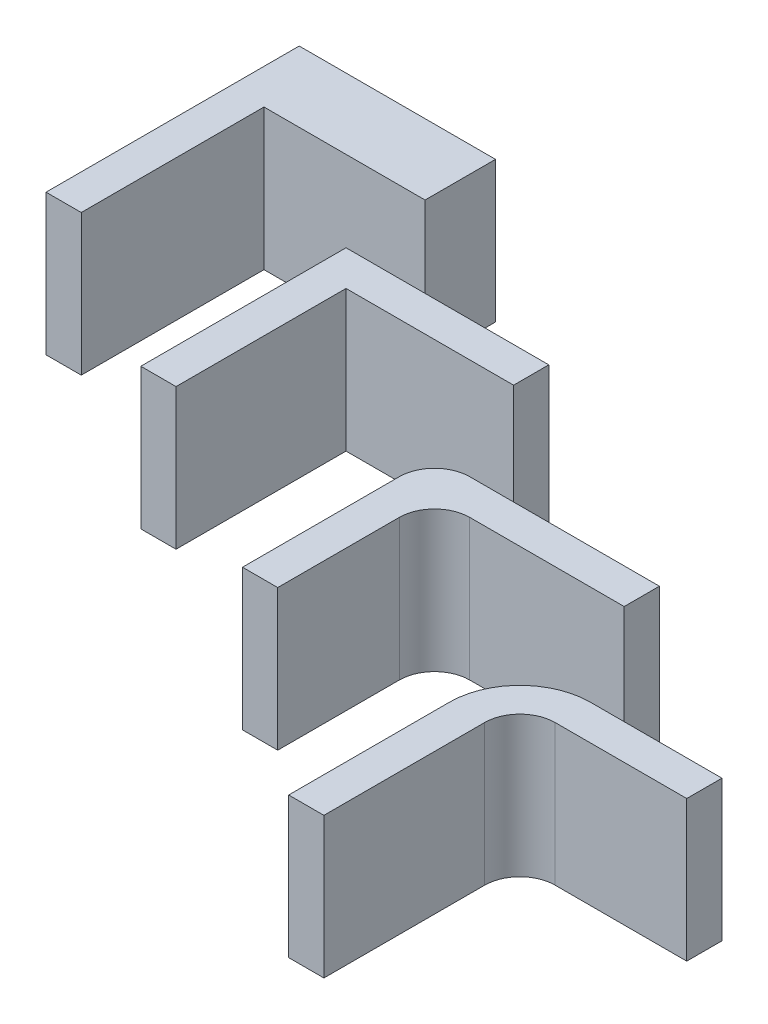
ISO-10303-21;
HEADER;
FILE_DESCRIPTION(('STEP AP214'),'2;1');
FILE_NAME('part.step','',(''),(''),'','','');
FILE_SCHEMA(('AUTOMOTIVE_DESIGN { 1 0 10303 214 1 1 1 1 }'));
ENDSEC;
DATA;
#1=APPLICATION_CONTEXT('core data for automotive mechanical design processes');
#2=APPLICATION_PROTOCOL_DEFINITION('international standard','automotive_design',2000,#1);
#3=PRODUCT_CONTEXT('',#1,'mechanical');
#4=PRODUCT('Part','Part','',(#3));
#5=PRODUCT_RELATED_PRODUCT_CATEGORY('part','',(#4));
#6=PRODUCT_DEFINITION_FORMATION('','',#4);
#7=PRODUCT_DEFINITION_CONTEXT('part definition',#1,'design');
#8=PRODUCT_DEFINITION('design','',#6,#7);
#9=PRODUCT_DEFINITION_SHAPE('','',#8);
#10=(LENGTH_UNIT() NAMED_UNIT(*) SI_UNIT(.MILLI.,.METRE.));
#11=(NAMED_UNIT(*) PLANE_ANGLE_UNIT() SI_UNIT($,.RADIAN.));
#12=(NAMED_UNIT(*) SI_UNIT($,.STERADIAN.) SOLID_ANGLE_UNIT());
#13=UNCERTAINTY_MEASURE_WITH_UNIT(LENGTH_MEASURE(1.E-05),#10,'distance_accuracy_value','');
#14=(GEOMETRIC_REPRESENTATION_CONTEXT(3) GLOBAL_UNCERTAINTY_ASSIGNED_CONTEXT((#13)) GLOBAL_UNIT_ASSIGNED_CONTEXT((#10,
#11,#12)) REPRESENTATION_CONTEXT('',''));
#15=CARTESIAN_POINT('',(0.,0.,0.));
#16=DIRECTION('',(0.,0.,1.));
#17=DIRECTION('',(1.,0.,0.));
#18=AXIS2_PLACEMENT_3D('',#15,#16,#17);
#19=CARTESIAN_POINT('',(120.02384587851,20.,24.0672258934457));
#20=DIRECTION('',(-1.,0.,0.));
#21=DIRECTION('',(0.,0.,1.));
#22=AXIS2_PLACEMENT_3D('',#19,#20,#21);
#23=PLANE('',#22);
#24=DIRECTION('',(0.,0.,-1.));
#25=VECTOR('',#24,1.);
#26=CARTESIAN_POINT('',(120.02384587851,0.,24.0672258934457));
#27=LINE('',#26,#25);
#28=CARTESIAN_POINT('',(120.02384587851,0.,29.0672258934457));
#29=VERTEX_POINT('',#28);
#30=CARTESIAN_POINT('',(120.02384587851,0.,24.0672258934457));
#31=VERTEX_POINT('',#30);
#32=EDGE_CURVE('E143',#29,#31,#27,.T.);
#33=ORIENTED_EDGE('',*,*,#32,.T.);
#34=DIRECTION('',(0.,-1.,0.));
#35=VECTOR('',#34,1.);
#36=CARTESIAN_POINT('',(120.02384587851,20.,24.0672258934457));
#37=LINE('',#36,#35);
#38=CARTESIAN_POINT('',(120.02384587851,20.,24.0672258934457));
#39=VERTEX_POINT('',#38);
#40=EDGE_CURVE('E12',#39,#31,#37,.T.);
#41=ORIENTED_EDGE('',*,*,#40,.F.);
#42=DIRECTION('',(0.,0.,-1.));
#43=VECTOR('',#42,1.);
#44=CARTESIAN_POINT('',(120.02384587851,20.,24.0672258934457));
#45=LINE('',#44,#43);
#46=CARTESIAN_POINT('',(120.02384587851,20.,29.0672258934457));
#47=VERTEX_POINT('',#46);
#48=EDGE_CURVE('E157',#47,#39,#45,.T.);
#49=ORIENTED_EDGE('',*,*,#48,.F.);
#50=DIRECTION('',(0.,-1.,0.));
#51=VECTOR('',#50,1.);
#52=CARTESIAN_POINT('',(120.02384587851,20.,29.0672258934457));
#53=LINE('',#52,#51);
#54=EDGE_CURVE('E139',#47,#29,#53,.T.);
#55=ORIENTED_EDGE('',*,*,#54,.T.);
#56=EDGE_LOOP('',(#33,#41,#49,#55));
#57=FACE_BOUND('',#56,.T.);
#58=ADVANCED_FACE('F47',(#57),#23,.F.);
#59=CARTESIAN_POINT('',(120.02384587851,20.,24.0672258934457));
#60=DIRECTION('',(0.,0.,1.));
#61=DIRECTION('',(1.,0.,0.));
#62=AXIS2_PLACEMENT_3D('',#59,#60,#61);
#63=PLANE('',#62);
#64=DIRECTION('',(-1.,0.,0.));
#65=VECTOR('',#64,1.);
#66=CARTESIAN_POINT('',(120.02384587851,0.,24.0672258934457));
#67=LINE('',#66,#65);
#68=CARTESIAN_POINT('',(101.336441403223,0.,24.0672258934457));
#69=VERTEX_POINT('',#68);
#70=EDGE_CURVE('E146',#31,#69,#67,.T.);
#71=ORIENTED_EDGE('',*,*,#70,.T.);
#72=DIRECTION('',(0.,-1.,0.));
#73=VECTOR('',#72,1.);
#74=CARTESIAN_POINT('',(101.336441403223,20.,24.0672258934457));
#75=LINE('',#74,#73);
#76=CARTESIAN_POINT('',(101.336441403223,20.,24.0672258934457));
#77=VERTEX_POINT('',#76);
#78=EDGE_CURVE('E55',#77,#69,#75,.T.);
#79=ORIENTED_EDGE('',*,*,#78,.F.);
#80=DIRECTION('',(-1.,0.,0.));
#81=VECTOR('',#80,1.);
#82=CARTESIAN_POINT('',(120.02384587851,20.,24.0672258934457));
#83=LINE('',#82,#81);
#84=EDGE_CURVE('E106',#39,#77,#83,.T.);
#85=ORIENTED_EDGE('',*,*,#84,.F.);
#86=ORIENTED_EDGE('',*,*,#40,.T.);
#87=EDGE_LOOP('',(#71,#79,#85,#86));
#88=FACE_BOUND('',#87,.T.);
#89=ADVANCED_FACE('F192',(#88),#63,.F.);
#90=CARTESIAN_POINT('',(101.336441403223,20.,34.0672258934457));
#91=DIRECTION('',(0.,-1.,0.));
#92=DIRECTION('',(0.,0.,-1.));
#93=AXIS2_PLACEMENT_3D('',#90,#91,#92);
#94=CYLINDRICAL_SURFACE('',#93,10.);
#95=CARTESIAN_POINT('',(101.336441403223,0.,34.0672258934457));
#96=DIRECTION('',(0.,1.,0.));
#97=DIRECTION('',(0.,0.,1.));
#98=AXIS2_PLACEMENT_3D('',#95,#96,#97);
#99=CIRCLE('',#98,10.);
#100=CARTESIAN_POINT('',(91.3364414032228,0.,34.0672258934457));
#101=VERTEX_POINT('',#100);
#102=EDGE_CURVE('E148',#69,#101,#99,.T.);
#103=ORIENTED_EDGE('',*,*,#102,.T.);
#104=DIRECTION('',(0.,-1.,0.));
#105=VECTOR('',#104,1.);
#106=CARTESIAN_POINT('',(91.3364414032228,20.,34.0672258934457));
#107=LINE('',#106,#105);
#108=CARTESIAN_POINT('',(91.3364414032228,20.,34.0672258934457));
#109=VERTEX_POINT('',#108);
#110=EDGE_CURVE('E164',#109,#101,#107,.T.);
#111=ORIENTED_EDGE('',*,*,#110,.F.);
#112=CARTESIAN_POINT('',(101.336441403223,20.,34.0672258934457));
#113=DIRECTION('',(0.,1.,0.));
#114=DIRECTION('',(0.,0.,1.));
#115=AXIS2_PLACEMENT_3D('',#112,#113,#114);
#116=CIRCLE('',#115,10.);
#117=EDGE_CURVE('E172',#77,#109,#116,.T.);
#118=ORIENTED_EDGE('',*,*,#117,.F.);
#119=ORIENTED_EDGE('',*,*,#78,.T.);
#120=EDGE_LOOP('',(#103,#111,#118,#119));
#121=FACE_BOUND('',#120,.T.);
#122=ADVANCED_FACE('F170',(#121),#94,.T.);
#123=CARTESIAN_POINT('',(91.3364414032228,20.,34.0672258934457));
#124=DIRECTION('',(1.,0.,0.));
#125=DIRECTION('',(0.,0.,-1.));
#126=AXIS2_PLACEMENT_3D('',#123,#124,#125);
#127=PLANE('',#126);
#128=DIRECTION('',(0.,0.,1.));
#129=VECTOR('',#128,1.);
#130=CARTESIAN_POINT('',(91.3364414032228,0.,34.0672258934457));
#131=LINE('',#130,#129);
#132=CARTESIAN_POINT('',(91.3364414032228,0.,56.8897151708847));
#133=VERTEX_POINT('',#132);
#134=EDGE_CURVE('E150',#101,#133,#131,.T.);
#135=ORIENTED_EDGE('',*,*,#134,.T.);
#136=DIRECTION('',(0.,-1.,0.));
#137=VECTOR('',#136,1.);
#138=CARTESIAN_POINT('',(91.3364414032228,20.,56.8897151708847));
#139=LINE('',#138,#137);
#140=CARTESIAN_POINT('',(91.3364414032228,20.,56.8897151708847));
#141=VERTEX_POINT('',#140);
#142=EDGE_CURVE('E161',#141,#133,#139,.T.);
#143=ORIENTED_EDGE('',*,*,#142,.F.);
#144=DIRECTION('',(0.,0.,1.));
#145=VECTOR('',#144,1.);
#146=CARTESIAN_POINT('',(91.3364414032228,20.,34.0672258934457));
#147=LINE('',#146,#145);
#148=EDGE_CURVE('E184',#109,#141,#147,.T.);
#149=ORIENTED_EDGE('',*,*,#148,.F.);
#150=ORIENTED_EDGE('',*,*,#110,.T.);
#151=EDGE_LOOP('',(#135,#143,#149,#150));
#152=FACE_BOUND('',#151,.T.);
#153=ADVANCED_FACE('F180',(#152),#127,.F.);
#154=CARTESIAN_POINT('',(96.3364414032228,20.,56.8897151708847));
#155=DIRECTION('',(0.,0.,-1.));
#156=DIRECTION('',(-1.,0.,0.));
#157=AXIS2_PLACEMENT_3D('',#154,#155,#156);
#158=PLANE('',#157);
#159=DIRECTION('',(1.,0.,0.));
#160=VECTOR('',#159,1.);
#161=CARTESIAN_POINT('',(96.3364414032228,0.,56.8897151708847));
#162=LINE('',#161,#160);
#163=CARTESIAN_POINT('',(96.3364414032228,0.,56.8897151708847));
#164=VERTEX_POINT('',#163);
#165=EDGE_CURVE('E152',#133,#164,#162,.T.);
#166=ORIENTED_EDGE('',*,*,#165,.T.);
#167=DIRECTION('',(0.,-1.,0.));
#168=VECTOR('',#167,1.);
#169=CARTESIAN_POINT('',(96.3364414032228,20.,56.8897151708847));
#170=LINE('',#169,#168);
#171=CARTESIAN_POINT('',(96.3364414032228,20.,56.8897151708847));
#172=VERTEX_POINT('',#171);
#173=EDGE_CURVE('E134',#172,#164,#170,.T.);
#174=ORIENTED_EDGE('',*,*,#173,.F.);
#175=DIRECTION('',(1.,0.,0.));
#176=VECTOR('',#175,1.);
#177=CARTESIAN_POINT('',(96.3364414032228,20.,56.8897151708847));
#178=LINE('',#177,#176);
#179=EDGE_CURVE('E125',#141,#172,#178,.T.);
#180=ORIENTED_EDGE('',*,*,#179,.F.);
#181=ORIENTED_EDGE('',*,*,#142,.T.);
#182=EDGE_LOOP('',(#166,#174,#180,#181));
#183=FACE_BOUND('',#182,.T.);
#184=ADVANCED_FACE('F183',(#183),#158,.F.);
#185=CARTESIAN_POINT('',(96.3364414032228,20.,34.0672258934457));
#186=DIRECTION('',(-1.,0.,0.));
#187=DIRECTION('',(0.,0.,1.));
#188=AXIS2_PLACEMENT_3D('',#185,#186,#187);
#189=PLANE('',#188);
#190=DIRECTION('',(0.,0.,-1.));
#191=VECTOR('',#190,1.);
#192=CARTESIAN_POINT('',(96.3364414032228,0.,34.0672258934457));
#193=LINE('',#192,#191);
#194=CARTESIAN_POINT('',(96.3364414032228,0.,34.0672258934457));
#195=VERTEX_POINT('',#194);
#196=EDGE_CURVE('E133',#164,#195,#193,.T.);
#197=ORIENTED_EDGE('',*,*,#196,.T.);
#198=DIRECTION('',(0.,-1.,0.));
#199=VECTOR('',#198,1.);
#200=CARTESIAN_POINT('',(96.3364414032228,20.,34.0672258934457));
#201=LINE('',#200,#199);
#202=CARTESIAN_POINT('',(96.3364414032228,20.,34.0672258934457));
#203=VERTEX_POINT('',#202);
#204=EDGE_CURVE('E130',#203,#195,#201,.T.);
#205=ORIENTED_EDGE('',*,*,#204,.F.);
#206=DIRECTION('',(0.,0.,-1.));
#207=VECTOR('',#206,1.);
#208=CARTESIAN_POINT('',(96.3364414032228,20.,34.0672258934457));
#209=LINE('',#208,#207);
#210=EDGE_CURVE('E119',#172,#203,#209,.T.);
#211=ORIENTED_EDGE('',*,*,#210,.F.);
#212=ORIENTED_EDGE('',*,*,#173,.T.);
#213=EDGE_LOOP('',(#197,#205,#211,#212));
#214=FACE_BOUND('',#213,.T.);
#215=ADVANCED_FACE('F131',(#214),#189,.F.);
#216=CARTESIAN_POINT('',(101.336441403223,20.,34.0672258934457));
#217=DIRECTION('',(0.,-1.,0.));
#218=DIRECTION('',(0.,0.,-1.));
#219=AXIS2_PLACEMENT_3D('',#216,#217,#218);
#220=CYLINDRICAL_SURFACE('',#219,4.99999999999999);
#221=CARTESIAN_POINT('',(101.336441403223,0.,34.0672258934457));
#222=DIRECTION('',(0.,-1.,0.));
#223=DIRECTION('',(0.,0.,1.));
#224=AXIS2_PLACEMENT_3D('',#221,#222,#223);
#225=CIRCLE('',#224,4.99999999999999);
#226=CARTESIAN_POINT('',(101.336441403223,0.,29.0672258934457));
#227=VERTEX_POINT('',#226);
#228=EDGE_CURVE('E92',#195,#227,#225,.T.);
#229=ORIENTED_EDGE('',*,*,#228,.T.);
#230=DIRECTION('',(0.,-1.,0.));
#231=VECTOR('',#230,1.);
#232=CARTESIAN_POINT('',(101.336441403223,20.,29.0672258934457));
#233=LINE('',#232,#231);
#234=CARTESIAN_POINT('',(101.336441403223,20.,29.0672258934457));
#235=VERTEX_POINT('',#234);
#236=EDGE_CURVE('E135',#235,#227,#233,.T.);
#237=ORIENTED_EDGE('',*,*,#236,.F.);
#238=CARTESIAN_POINT('',(101.336441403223,20.,34.0672258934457));
#239=DIRECTION('',(0.,-1.,0.));
#240=DIRECTION('',(0.,0.,1.));
#241=AXIS2_PLACEMENT_3D('',#238,#239,#240);
#242=CIRCLE('',#241,4.99999999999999);
#243=EDGE_CURVE('E123',#203,#235,#242,.T.);
#244=ORIENTED_EDGE('',*,*,#243,.F.);
#245=ORIENTED_EDGE('',*,*,#204,.T.);
#246=EDGE_LOOP('',(#229,#237,#244,#245));
#247=FACE_BOUND('',#246,.T.);
#248=ADVANCED_FACE('F137',(#247),#220,.F.);
#249=CARTESIAN_POINT('',(120.02384587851,20.,29.0672258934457));
#250=DIRECTION('',(0.,0.,-1.));
#251=DIRECTION('',(-1.,0.,0.));
#252=AXIS2_PLACEMENT_3D('',#249,#250,#251);
#253=PLANE('',#252);
#254=DIRECTION('',(1.,0.,0.));
#255=VECTOR('',#254,1.);
#256=CARTESIAN_POINT('',(120.02384587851,0.,29.0672258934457));
#257=LINE('',#256,#255);
#258=EDGE_CURVE('E98',#227,#29,#257,.T.);
#259=ORIENTED_EDGE('',*,*,#258,.T.);
#260=ORIENTED_EDGE('',*,*,#54,.F.);
#261=DIRECTION('',(1.,0.,0.));
#262=VECTOR('',#261,1.);
#263=CARTESIAN_POINT('',(120.02384587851,20.,29.0672258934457));
#264=LINE('',#263,#262);
#265=EDGE_CURVE('E63',#235,#47,#264,.T.);
#266=ORIENTED_EDGE('',*,*,#265,.F.);
#267=ORIENTED_EDGE('',*,*,#236,.T.);
#268=EDGE_LOOP('',(#259,#260,#266,#267));
#269=FACE_BOUND('',#268,.T.);
#270=ADVANCED_FACE('F208',(#269),#253,.F.);
#271=CARTESIAN_POINT('',(101.336441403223,20.,34.0672258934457));
#272=DIRECTION('',(0.,1.,0.));
#273=DIRECTION('',(0.,0.,1.));
#274=AXIS2_PLACEMENT_3D('',#271,#272,#273);
#275=PLANE('',#274);
#276=ORIENTED_EDGE('',*,*,#48,.T.);
#277=ORIENTED_EDGE('',*,*,#84,.T.);
#278=ORIENTED_EDGE('',*,*,#117,.T.);
#279=ORIENTED_EDGE('',*,*,#148,.T.);
#280=ORIENTED_EDGE('',*,*,#179,.T.);
#281=ORIENTED_EDGE('',*,*,#210,.T.);
#282=ORIENTED_EDGE('',*,*,#243,.T.);
#283=ORIENTED_EDGE('',*,*,#265,.T.);
#284=EDGE_LOOP('',(#276,#277,#278,#279,#280,#281,#282,#283));
#285=FACE_BOUND('',#284,.T.);
#286=ADVANCED_FACE('F121',(#285),#275,.T.);
#287=CARTESIAN_POINT('',(101.336441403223,0.,34.0672258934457));
#288=DIRECTION('',(0.,1.,0.));
#289=DIRECTION('',(0.,0.,1.));
#290=AXIS2_PLACEMENT_3D('',#287,#288,#289);
#291=PLANE('',#290);
#292=ORIENTED_EDGE('',*,*,#32,.F.);
#293=ORIENTED_EDGE('',*,*,#258,.F.);
#294=ORIENTED_EDGE('',*,*,#228,.F.);
#295=ORIENTED_EDGE('',*,*,#196,.F.);
#296=ORIENTED_EDGE('',*,*,#165,.F.);
#297=ORIENTED_EDGE('',*,*,#134,.F.);
#298=ORIENTED_EDGE('',*,*,#102,.F.);
#299=ORIENTED_EDGE('',*,*,#70,.F.);
#300=EDGE_LOOP('',(#292,#293,#294,#295,#296,#297,#298,#299));
#301=FACE_BOUND('',#300,.T.);
#302=ADVANCED_FACE('F176',(#301),#291,.F.);
#303=CLOSED_SHELL('',(#58,#89,#122,#153,#184,#215,#248,#270,#286,#302));
#304=MANIFOLD_SOLID_BREP('B2',#303);
#305=CARTESIAN_POINT('',(0.,20.,9.90528930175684));
#306=DIRECTION('',(0.,0.,-1.));
#307=DIRECTION('',(-1.,0.,0.));
#308=AXIS2_PLACEMENT_3D('',#305,#306,#307);
#309=PLANE('',#308);
#310=DIRECTION('',(1.,0.,0.));
#311=VECTOR('',#310,1.);
#312=CARTESIAN_POINT('',(0.,20.,9.90528930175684));
#313=LINE('',#312,#311);
#314=CARTESIAN_POINT('',(70.0548102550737,20.,9.90528930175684));
#315=VERTEX_POINT('',#314);
#316=CARTESIAN_POINT('',(91.9806908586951,20.,9.90528930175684));
#317=VERTEX_POINT('',#316);
#318=EDGE_CURVE('E346',#315,#317,#313,.T.);
#319=ORIENTED_EDGE('',*,*,#318,.F.);
#320=DIRECTION('',(0.,-1.,0.));
#321=VECTOR('',#320,1.);
#322=CARTESIAN_POINT('',(70.0548102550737,0.,9.90528930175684));
#323=LINE('',#322,#321);
#324=CARTESIAN_POINT('',(70.0548102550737,0.,9.90528930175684));
#325=VERTEX_POINT('',#324);
#326=EDGE_CURVE('E384',#315,#325,#323,.T.);
#327=ORIENTED_EDGE('',*,*,#326,.T.);
#328=DIRECTION('',(1.,0.,0.));
#329=VECTOR('',#328,1.);
#330=CARTESIAN_POINT('',(0.,0.,9.90528930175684));
#331=LINE('',#330,#329);
#332=CARTESIAN_POINT('',(91.9806908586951,0.,9.90528930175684));
#333=VERTEX_POINT('',#332);
#334=EDGE_CURVE('E368',#325,#333,#331,.T.);
#335=ORIENTED_EDGE('',*,*,#334,.T.);
#336=DIRECTION('',(0.,-1.,0.));
#337=VECTOR('',#336,1.);
#338=CARTESIAN_POINT('',(91.9806908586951,20.,9.90528930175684));
#339=LINE('',#338,#337);
#340=EDGE_CURVE('E361',#317,#333,#339,.T.);
#341=ORIENTED_EDGE('',*,*,#340,.F.);
#342=EDGE_LOOP('',(#319,#327,#335,#341));
#343=FACE_BOUND('',#342,.T.);
#344=ADVANCED_FACE('F284',(#343),#309,.F.);
#345=CARTESIAN_POINT('',(91.980690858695,20.,-5.1059540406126E-13));
#346=DIRECTION('',(-1.,0.,0.));
#347=DIRECTION('',(0.,0.,1.));
#348=AXIS2_PLACEMENT_3D('',#345,#346,#347);
#349=PLANE('',#348);
#350=DIRECTION('',(0.,0.,-1.));
#351=VECTOR('',#350,1.);
#352=CARTESIAN_POINT('',(91.980690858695,0.,-5.1059540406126E-13));
#353=LINE('',#352,#351);
#354=CARTESIAN_POINT('',(91.9806908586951,0.,4.90528930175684));
#355=VERTEX_POINT('',#354);
#356=EDGE_CURVE('E501',#333,#355,#353,.T.);
#357=ORIENTED_EDGE('',*,*,#356,.T.);
#358=DIRECTION('',(0.,-1.,0.));
#359=VECTOR('',#358,1.);
#360=CARTESIAN_POINT('',(91.9806908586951,20.,4.90528930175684));
#361=LINE('',#360,#359);
#362=CARTESIAN_POINT('',(91.9806908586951,20.,4.90528930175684));
#363=VERTEX_POINT('',#362);
#364=EDGE_CURVE('E363',#363,#355,#361,.T.);
#365=ORIENTED_EDGE('',*,*,#364,.F.);
#366=DIRECTION('',(0.,0.,-1.));
#367=VECTOR('',#366,1.);
#368=CARTESIAN_POINT('',(91.980690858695,20.,-5.1059540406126E-13));
#369=LINE('',#368,#367);
#370=EDGE_CURVE('E350',#317,#363,#369,.T.);
#371=ORIENTED_EDGE('',*,*,#370,.F.);
#372=ORIENTED_EDGE('',*,*,#340,.T.);
#373=EDGE_LOOP('',(#357,#365,#371,#372));
#374=FACE_BOUND('',#373,.T.);
#375=ADVANCED_FACE('F360',(#374),#349,.F.);
#376=CARTESIAN_POINT('',(0.,20.,4.90528930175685));
#377=DIRECTION('',(0.,0.,1.));
#378=DIRECTION('',(1.,0.,0.));
#379=AXIS2_PLACEMENT_3D('',#376,#377,#378);
#380=PLANE('',#379);
#381=DIRECTION('',(-1.,0.,0.));
#382=VECTOR('',#381,1.);
#383=CARTESIAN_POINT('',(0.,0.,4.90528930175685));
#384=LINE('',#383,#382);
#385=CARTESIAN_POINT('',(65.0548102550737,0.,4.90528930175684));
#386=VERTEX_POINT('',#385);
#387=EDGE_CURVE('E489',#355,#386,#384,.T.);
#388=ORIENTED_EDGE('',*,*,#387,.T.);
#389=DIRECTION('',(0.,-1.,0.));
#390=VECTOR('',#389,1.);
#391=CARTESIAN_POINT('',(65.0548102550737,20.,4.90528930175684));
#392=LINE('',#391,#390);
#393=CARTESIAN_POINT('',(65.0548102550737,20.,4.90528930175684));
#394=VERTEX_POINT('',#393);
#395=EDGE_CURVE('E380',#386,#394,#392,.F.);
#396=ORIENTED_EDGE('',*,*,#395,.T.);
#397=DIRECTION('',(-1.,0.,0.));
#398=VECTOR('',#397,1.);
#399=CARTESIAN_POINT('',(0.,20.,4.90528930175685));
#400=LINE('',#399,#398);
#401=EDGE_CURVE('E365',#363,#394,#400,.T.);
#402=ORIENTED_EDGE('',*,*,#401,.F.);
#403=ORIENTED_EDGE('',*,*,#364,.T.);
#404=EDGE_LOOP('',(#388,#396,#402,#403));
#405=FACE_BOUND('',#404,.T.);
#406=ADVANCED_FACE('F409',(#405),#380,.F.);
#407=CARTESIAN_POINT('',(60.0548102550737,20.,0.));
#408=DIRECTION('',(1.,0.,0.));
#409=DIRECTION('',(0.,0.,-1.));
#410=AXIS2_PLACEMENT_3D('',#407,#408,#409);
#411=PLANE('',#410);
#412=DIRECTION('',(0.,0.,1.));
#413=VECTOR('',#412,1.);
#414=CARTESIAN_POINT('',(60.0548102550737,20.,0.));
#415=LINE('',#414,#413);
#416=CARTESIAN_POINT('',(60.0548102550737,20.,9.90528930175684));
#417=VERTEX_POINT('',#416);
#418=CARTESIAN_POINT('',(60.0548102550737,20.,32.1637273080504));
#419=VERTEX_POINT('',#418);
#420=EDGE_CURVE('E496',#417,#419,#415,.T.);
#421=ORIENTED_EDGE('',*,*,#420,.F.);
#422=DIRECTION('',(0.,-1.,0.));
#423=VECTOR('',#422,1.);
#424=CARTESIAN_POINT('',(60.0548102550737,20.,9.90528930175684));
#425=LINE('',#424,#423);
#426=CARTESIAN_POINT('',(60.0548102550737,0.,9.90528930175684));
#427=VERTEX_POINT('',#426);
#428=EDGE_CURVE('E370',#417,#427,#425,.T.);
#429=ORIENTED_EDGE('',*,*,#428,.T.);
#430=DIRECTION('',(0.,0.,1.));
#431=VECTOR('',#430,1.);
#432=CARTESIAN_POINT('',(60.0548102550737,0.,0.));
#433=LINE('',#432,#431);
#434=CARTESIAN_POINT('',(60.0548102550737,0.,32.1637273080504));
#435=VERTEX_POINT('',#434);
#436=EDGE_CURVE('E487',#427,#435,#433,.T.);
#437=ORIENTED_EDGE('',*,*,#436,.T.);
#438=DIRECTION('',(0.,-1.,0.));
#439=VECTOR('',#438,1.);
#440=CARTESIAN_POINT('',(60.0548102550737,20.,32.1637273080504));
#441=LINE('',#440,#439);
#442=EDGE_CURVE('E375',#419,#435,#441,.T.);
#443=ORIENTED_EDGE('',*,*,#442,.F.);
#444=EDGE_LOOP('',(#421,#429,#437,#443));
#445=FACE_BOUND('',#444,.T.);
#446=ADVANCED_FACE('F414',(#445),#411,.F.);
#447=CARTESIAN_POINT('',(0.,20.,32.1637273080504));
#448=DIRECTION('',(0.,0.,-1.));
#449=DIRECTION('',(-1.,0.,0.));
#450=AXIS2_PLACEMENT_3D('',#447,#448,#449);
#451=PLANE('',#450);
#452=DIRECTION('',(1.,0.,0.));
#453=VECTOR('',#452,1.);
#454=CARTESIAN_POINT('',(0.,0.,32.1637273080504));
#455=LINE('',#454,#453);
#456=CARTESIAN_POINT('',(65.0548102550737,0.,32.1637273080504));
#457=VERTEX_POINT('',#456);
#458=EDGE_CURVE('E396',#435,#457,#455,.T.);
#459=ORIENTED_EDGE('',*,*,#458,.T.);
#460=DIRECTION('',(0.,-1.,0.));
#461=VECTOR('',#460,1.);
#462=CARTESIAN_POINT('',(65.0548102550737,20.,32.1637273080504));
#463=LINE('',#462,#461);
#464=CARTESIAN_POINT('',(65.0548102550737,20.,32.1637273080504));
#465=VERTEX_POINT('',#464);
#466=EDGE_CURVE('E395',#465,#457,#463,.T.);
#467=ORIENTED_EDGE('',*,*,#466,.F.);
#468=DIRECTION('',(1.,0.,0.));
#469=VECTOR('',#468,1.);
#470=CARTESIAN_POINT('',(0.,20.,32.1637273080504));
#471=LINE('',#470,#469);
#472=EDGE_CURVE('E494',#419,#465,#471,.T.);
#473=ORIENTED_EDGE('',*,*,#472,.F.);
#474=ORIENTED_EDGE('',*,*,#442,.T.);
#475=EDGE_LOOP('',(#459,#467,#473,#474));
#476=FACE_BOUND('',#475,.T.);
#477=ADVANCED_FACE('F418',(#476),#451,.F.);
#478=CARTESIAN_POINT('',(65.0548102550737,20.,0.));
#479=DIRECTION('',(-1.,0.,0.));
#480=DIRECTION('',(0.,0.,1.));
#481=AXIS2_PLACEMENT_3D('',#478,#479,#480);
#482=PLANE('',#481);
#483=DIRECTION('',(0.,0.,-1.));
#484=VECTOR('',#483,1.);
#485=CARTESIAN_POINT('',(65.0548102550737,0.,0.));
#486=LINE('',#485,#484);
#487=CARTESIAN_POINT('',(65.0548102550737,0.,14.9052893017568));
#488=VERTEX_POINT('',#487);
#489=EDGE_CURVE('E356',#457,#488,#486,.T.);
#490=ORIENTED_EDGE('',*,*,#489,.T.);
#491=DIRECTION('',(0.,-1.,0.));
#492=VECTOR('',#491,1.);
#493=CARTESIAN_POINT('',(65.0548102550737,20.,14.9052893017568));
#494=LINE('',#493,#492);
#495=CARTESIAN_POINT('',(65.0548102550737,20.,14.9052893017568));
#496=VERTEX_POINT('',#495);
#497=EDGE_CURVE('E299',#488,#496,#494,.F.);
#498=ORIENTED_EDGE('',*,*,#497,.T.);
#499=DIRECTION('',(0.,0.,-1.));
#500=VECTOR('',#499,1.);
#501=CARTESIAN_POINT('',(65.0548102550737,20.,0.));
#502=LINE('',#501,#500);
#503=EDGE_CURVE('E493',#465,#496,#502,.T.);
#504=ORIENTED_EDGE('',*,*,#503,.F.);
#505=ORIENTED_EDGE('',*,*,#466,.T.);
#506=EDGE_LOOP('',(#490,#498,#504,#505));
#507=FACE_BOUND('',#506,.T.);
#508=ADVANCED_FACE('F393',(#507),#482,.F.);
#509=CARTESIAN_POINT('',(0.,20.,0.));
#510=DIRECTION('',(0.,1.,0.));
#511=DIRECTION('',(0.,0.,1.));
#512=AXIS2_PLACEMENT_3D('',#509,#510,#511);
#513=PLANE('',#512);
#514=ORIENTED_EDGE('',*,*,#401,.T.);
#515=CARTESIAN_POINT('',(65.0548102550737,20.,9.90528930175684));
#516=DIRECTION('',(0.,1.,0.));
#517=DIRECTION('',(0.,0.,1.));
#518=AXIS2_PLACEMENT_3D('',#515,#516,#517);
#519=CIRCLE('',#518,5.);
#520=EDGE_CURVE('E382',#394,#417,#519,.T.);
#521=ORIENTED_EDGE('',*,*,#520,.T.);
#522=ORIENTED_EDGE('',*,*,#420,.T.);
#523=ORIENTED_EDGE('',*,*,#472,.T.);
#524=ORIENTED_EDGE('',*,*,#503,.T.);
#525=CARTESIAN_POINT('',(70.0548102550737,20.,14.9052893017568));
#526=DIRECTION('',(0.,1.,0.));
#527=DIRECTION('',(0.,0.,1.));
#528=AXIS2_PLACEMENT_3D('',#525,#526,#527);
#529=CIRCLE('',#528,5.);
#530=EDGE_CURVE('E45',#496,#315,#529,.F.);
#531=ORIENTED_EDGE('',*,*,#530,.T.);
#532=ORIENTED_EDGE('',*,*,#318,.T.);
#533=ORIENTED_EDGE('',*,*,#370,.T.);
#534=EDGE_LOOP('',(#514,#521,#522,#523,#524,#531,#532,#533));
#535=FACE_BOUND('',#534,.T.);
#536=ADVANCED_FACE('F349',(#535),#513,.T.);
#537=CARTESIAN_POINT('',(0.,0.,0.));
#538=DIRECTION('',(0.,1.,0.));
#539=DIRECTION('',(0.,0.,1.));
#540=AXIS2_PLACEMENT_3D('',#537,#538,#539);
#541=PLANE('',#540);
#542=ORIENTED_EDGE('',*,*,#436,.F.);
#543=CARTESIAN_POINT('',(65.0548102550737,0.,9.90528930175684));
#544=DIRECTION('',(0.,1.,0.));
#545=DIRECTION('',(0.,0.,1.));
#546=AXIS2_PLACEMENT_3D('',#543,#544,#545);
#547=CIRCLE('',#546,5.);
#548=EDGE_CURVE('E373',#427,#386,#547,.F.);
#549=ORIENTED_EDGE('',*,*,#548,.T.);
#550=ORIENTED_EDGE('',*,*,#387,.F.);
#551=ORIENTED_EDGE('',*,*,#356,.F.);
#552=ORIENTED_EDGE('',*,*,#334,.F.);
#553=CARTESIAN_POINT('',(70.0548102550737,0.,14.9052893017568));
#554=DIRECTION('',(0.,1.,0.));
#555=DIRECTION('',(0.,0.,1.));
#556=AXIS2_PLACEMENT_3D('',#553,#554,#555);
#557=CIRCLE('',#556,5.);
#558=EDGE_CURVE('E292',#325,#488,#557,.T.);
#559=ORIENTED_EDGE('',*,*,#558,.T.);
#560=ORIENTED_EDGE('',*,*,#489,.F.);
#561=ORIENTED_EDGE('',*,*,#458,.F.);
#562=EDGE_LOOP('',(#542,#549,#550,#551,#552,#559,#560,#561));
#563=FACE_BOUND('',#562,.T.);
#564=ADVANCED_FACE('F389',(#563),#541,.F.);
#565=CARTESIAN_POINT('',(65.0548102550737,20.,9.90528930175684));
#566=DIRECTION('',(0.,-1.,0.));
#567=DIRECTION('',(0.,0.,-1.));
#568=AXIS2_PLACEMENT_3D('',#565,#566,#567);
#569=CYLINDRICAL_SURFACE('',#568,5.);
#570=ORIENTED_EDGE('',*,*,#520,.F.);
#571=ORIENTED_EDGE('',*,*,#395,.F.);
#572=ORIENTED_EDGE('',*,*,#548,.F.);
#573=ORIENTED_EDGE('',*,*,#428,.F.);
#574=EDGE_LOOP('',(#570,#571,#572,#573));
#575=FACE_BOUND('',#574,.T.);
#576=ADVANCED_FACE('F399',(#575),#569,.T.);
#577=CARTESIAN_POINT('',(70.0548102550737,20.,14.9052893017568));
#578=DIRECTION('',(0.,1.,0.));
#579=DIRECTION('',(0.,0.,1.));
#580=AXIS2_PLACEMENT_3D('',#577,#578,#579);
#581=CYLINDRICAL_SURFACE('',#580,5.);
#582=ORIENTED_EDGE('',*,*,#530,.F.);
#583=ORIENTED_EDGE('',*,*,#497,.F.);
#584=ORIENTED_EDGE('',*,*,#558,.F.);
#585=ORIENTED_EDGE('',*,*,#326,.F.);
#586=EDGE_LOOP('',(#582,#583,#584,#585));
#587=FACE_BOUND('',#586,.T.);
#588=ADVANCED_FACE('F286',(#587),#581,.F.);
#589=CLOSED_SHELL('',(#344,#375,#406,#446,#477,#508,#536,#564,#576,#588));
#590=MANIFOLD_SOLID_BREP('B6',#589);
#591=CARTESIAN_POINT('',(0.,20.,14.6730750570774));
#592=DIRECTION('',(0.,0.,1.));
#593=DIRECTION('',(1.,0.,0.));
#594=AXIS2_PLACEMENT_3D('',#591,#592,#593);
#595=PLANE('',#594);
#596=DIRECTION('',(-1.,0.,0.));
#597=VECTOR('',#596,1.);
#598=CARTESIAN_POINT('',(0.,0.,14.6730750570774));
#599=LINE('',#598,#597);
#600=CARTESIAN_POINT('',(33.1289296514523,0.,14.6730750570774));
#601=VERTEX_POINT('',#600);
#602=CARTESIAN_POINT('',(28.1289296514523,0.,14.6730750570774));
#603=VERTEX_POINT('',#602);
#604=EDGE_CURVE('E601',#601,#603,#599,.T.);
#605=ORIENTED_EDGE('',*,*,#604,.F.);
#606=DIRECTION('',(0.,-1.,0.));
#607=VECTOR('',#606,1.);
#608=CARTESIAN_POINT('',(33.1289296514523,20.,14.6730750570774));
#609=LINE('',#608,#607);
#610=CARTESIAN_POINT('',(33.1289296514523,20.,14.6730750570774));
#611=VERTEX_POINT('',#610);
#612=EDGE_CURVE('E282',#611,#601,#609,.T.);
#613=ORIENTED_EDGE('',*,*,#612,.F.);
#614=DIRECTION('',(-1.,0.,0.));
#615=VECTOR('',#614,1.);
#616=CARTESIAN_POINT('',(0.,20.,14.6730750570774));
#617=LINE('',#616,#615);
#618=CARTESIAN_POINT('',(28.1289296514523,20.,14.6730750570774));
#619=VERTEX_POINT('',#618);
#620=EDGE_CURVE('E615',#611,#619,#617,.T.);
#621=ORIENTED_EDGE('',*,*,#620,.T.);
#622=DIRECTION('',(0.,-1.,0.));
#623=VECTOR('',#622,1.);
#624=CARTESIAN_POINT('',(28.1289296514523,20.,14.6730750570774));
#625=LINE('',#624,#623);
#626=EDGE_CURVE('E536',#619,#603,#625,.T.);
#627=ORIENTED_EDGE('',*,*,#626,.T.);
#628=EDGE_LOOP('',(#605,#613,#621,#627));
#629=FACE_BOUND('',#628,.T.);
#630=ADVANCED_FACE('F520',(#629),#595,.T.);
#631=CARTESIAN_POINT('',(33.1289296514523,20.,0.));
#632=DIRECTION('',(1.,0.,0.));
#633=DIRECTION('',(0.,0.,-1.));
#634=AXIS2_PLACEMENT_3D('',#631,#632,#633);
#635=PLANE('',#634);
#636=DIRECTION('',(0.,0.,1.));
#637=VECTOR('',#636,1.);
#638=CARTESIAN_POINT('',(33.1289296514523,0.,0.));
#639=LINE('',#638,#637);
#640=CARTESIAN_POINT('',(33.1289296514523,0.,-9.45958909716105));
#641=VERTEX_POINT('',#640);
#642=EDGE_CURVE('E603',#641,#601,#639,.T.);
#643=ORIENTED_EDGE('',*,*,#642,.F.);
#644=DIRECTION('',(0.,-1.,0.));
#645=VECTOR('',#644,1.);
#646=CARTESIAN_POINT('',(33.1289296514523,20.,-9.45958909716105));
#647=LINE('',#646,#645);
#648=CARTESIAN_POINT('',(33.1289296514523,20.,-9.45958909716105));
#649=VERTEX_POINT('',#648);
#650=EDGE_CURVE('E528',#649,#641,#647,.T.);
#651=ORIENTED_EDGE('',*,*,#650,.F.);
#652=DIRECTION('',(0.,0.,1.));
#653=VECTOR('',#652,1.);
#654=CARTESIAN_POINT('',(33.1289296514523,20.,0.));
#655=LINE('',#654,#653);
#656=EDGE_CURVE('E690',#649,#611,#655,.T.);
#657=ORIENTED_EDGE('',*,*,#656,.T.);
#658=ORIENTED_EDGE('',*,*,#612,.T.);
#659=EDGE_LOOP('',(#643,#651,#657,#658));
#660=FACE_BOUND('',#659,.T.);
#661=ADVANCED_FACE('F624',(#660),#635,.T.);
#662=CARTESIAN_POINT('',(0.,20.,-9.45958909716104));
#663=DIRECTION('',(0.,0.,1.));
#664=DIRECTION('',(1.,0.,0.));
#665=AXIS2_PLACEMENT_3D('',#662,#663,#664);
#666=PLANE('',#665);
#667=DIRECTION('',(-1.,0.,0.));
#668=VECTOR('',#667,1.);
#669=CARTESIAN_POINT('',(0.,0.,-9.45958909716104));
#670=LINE('',#669,#668);
#671=CARTESIAN_POINT('',(56.9145597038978,0.,-9.45958909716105));
#672=VERTEX_POINT('',#671);
#673=EDGE_CURVE('E606',#672,#641,#670,.T.);
#674=ORIENTED_EDGE('',*,*,#673,.F.);
#675=DIRECTION('',(0.,-1.,0.));
#676=VECTOR('',#675,1.);
#677=CARTESIAN_POINT('',(56.9145597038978,20.,-9.45958909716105));
#678=LINE('',#677,#676);
#679=CARTESIAN_POINT('',(56.9145597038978,20.,-9.45958909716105));
#680=VERTEX_POINT('',#679);
#681=EDGE_CURVE('E583',#680,#672,#678,.T.);
#682=ORIENTED_EDGE('',*,*,#681,.F.);
#683=DIRECTION('',(-1.,0.,0.));
#684=VECTOR('',#683,1.);
#685=CARTESIAN_POINT('',(0.,20.,-9.45958909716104));
#686=LINE('',#685,#684);
#687=EDGE_CURVE('E593',#680,#649,#686,.T.);
#688=ORIENTED_EDGE('',*,*,#687,.T.);
#689=ORIENTED_EDGE('',*,*,#650,.T.);
#690=EDGE_LOOP('',(#674,#682,#688,#689));
#691=FACE_BOUND('',#690,.T.);
#692=ADVANCED_FACE('F621',(#691),#666,.T.);
#693=CARTESIAN_POINT('',(56.9145597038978,20.,0.));
#694=DIRECTION('',(1.,0.,0.));
#695=DIRECTION('',(0.,0.,-1.));
#696=AXIS2_PLACEMENT_3D('',#693,#694,#695);
#697=PLANE('',#696);
#698=DIRECTION('',(0.,0.,1.));
#699=VECTOR('',#698,1.);
#700=CARTESIAN_POINT('',(56.9145597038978,0.,0.));
#701=LINE('',#700,#699);
#702=CARTESIAN_POINT('',(56.9145597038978,0.,-14.4595890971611));
#703=VERTEX_POINT('',#702);
#704=EDGE_CURVE('E579',#703,#672,#701,.T.);
#705=ORIENTED_EDGE('',*,*,#704,.F.);
#706=DIRECTION('',(0.,-1.,0.));
#707=VECTOR('',#706,1.);
#708=CARTESIAN_POINT('',(56.9145597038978,20.,-14.4595890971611));
#709=LINE('',#708,#707);
#710=CARTESIAN_POINT('',(56.9145597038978,20.,-14.4595890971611));
#711=VERTEX_POINT('',#710);
#712=EDGE_CURVE('E574',#711,#703,#709,.T.);
#713=ORIENTED_EDGE('',*,*,#712,.F.);
#714=DIRECTION('',(0.,0.,1.));
#715=VECTOR('',#714,1.);
#716=CARTESIAN_POINT('',(56.9145597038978,20.,0.));
#717=LINE('',#716,#715);
#718=EDGE_CURVE('E577',#711,#680,#717,.T.);
#719=ORIENTED_EDGE('',*,*,#718,.T.);
#720=ORIENTED_EDGE('',*,*,#681,.T.);
#721=EDGE_LOOP('',(#705,#713,#719,#720));
#722=FACE_BOUND('',#721,.T.);
#723=ADVANCED_FACE('F576',(#722),#697,.T.);
#724=CARTESIAN_POINT('',(0.,20.,-14.4595890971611));
#725=DIRECTION('',(0.,0.,-1.));
#726=DIRECTION('',(-1.,0.,0.));
#727=AXIS2_PLACEMENT_3D('',#724,#725,#726);
#728=PLANE('',#727);
#729=DIRECTION('',(1.,0.,0.));
#730=VECTOR('',#729,1.);
#731=CARTESIAN_POINT('',(0.,0.,-14.4595890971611));
#732=LINE('',#731,#730);
#733=CARTESIAN_POINT('',(28.1289296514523,0.,-14.4595890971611));
#734=VERTEX_POINT('',#733);
#735=EDGE_CURVE('E610',#734,#703,#732,.T.);
#736=ORIENTED_EDGE('',*,*,#735,.F.);
#737=DIRECTION('',(0.,-1.,0.));
#738=VECTOR('',#737,1.);
#739=CARTESIAN_POINT('',(28.1289296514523,20.,-14.4595890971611));
#740=LINE('',#739,#738);
#741=CARTESIAN_POINT('',(28.1289296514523,20.,-14.4595890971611));
#742=VERTEX_POINT('',#741);
#743=EDGE_CURVE('E555',#742,#734,#740,.T.);
#744=ORIENTED_EDGE('',*,*,#743,.F.);
#745=DIRECTION('',(1.,0.,0.));
#746=VECTOR('',#745,1.);
#747=CARTESIAN_POINT('',(0.,20.,-14.4595890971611));
#748=LINE('',#747,#746);
#749=EDGE_CURVE('E590',#742,#711,#748,.T.);
#750=ORIENTED_EDGE('',*,*,#749,.T.);
#751=ORIENTED_EDGE('',*,*,#712,.T.);
#752=EDGE_LOOP('',(#736,#744,#750,#751));
#753=FACE_BOUND('',#752,.T.);
#754=ADVANCED_FACE('F595',(#753),#728,.T.);
#755=CARTESIAN_POINT('',(28.1289296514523,20.,0.));
#756=DIRECTION('',(-1.,0.,0.));
#757=DIRECTION('',(0.,0.,1.));
#758=AXIS2_PLACEMENT_3D('',#755,#756,#757);
#759=PLANE('',#758);
#760=DIRECTION('',(0.,0.,-1.));
#761=VECTOR('',#760,1.);
#762=CARTESIAN_POINT('',(28.1289296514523,0.,0.));
#763=LINE('',#762,#761);
#764=EDGE_CURVE('E612',#603,#734,#763,.T.);
#765=ORIENTED_EDGE('',*,*,#764,.F.);
#766=ORIENTED_EDGE('',*,*,#626,.F.);
#767=DIRECTION('',(0.,0.,-1.));
#768=VECTOR('',#767,1.);
#769=CARTESIAN_POINT('',(28.1289296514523,20.,0.));
#770=LINE('',#769,#768);
#771=EDGE_CURVE('E596',#619,#742,#770,.T.);
#772=ORIENTED_EDGE('',*,*,#771,.T.);
#773=ORIENTED_EDGE('',*,*,#743,.T.);
#774=EDGE_LOOP('',(#765,#766,#772,#773));
#775=FACE_BOUND('',#774,.T.);
#776=ADVANCED_FACE('F627',(#775),#759,.T.);
#777=CARTESIAN_POINT('',(0.,20.,0.));
#778=DIRECTION('',(0.,1.,0.));
#779=DIRECTION('',(0.,0.,1.));
#780=AXIS2_PLACEMENT_3D('',#777,#778,#779);
#781=PLANE('',#780);
#782=ORIENTED_EDGE('',*,*,#620,.F.);
#783=ORIENTED_EDGE('',*,*,#656,.F.);
#784=ORIENTED_EDGE('',*,*,#687,.F.);
#785=ORIENTED_EDGE('',*,*,#718,.F.);
#786=ORIENTED_EDGE('',*,*,#749,.F.);
#787=ORIENTED_EDGE('',*,*,#771,.F.);
#788=EDGE_LOOP('',(#782,#783,#784,#785,#786,#787));
#789=FACE_BOUND('',#788,.T.);
#790=ADVANCED_FACE('F588',(#789),#781,.T.);
#791=CARTESIAN_POINT('',(0.,0.,0.));
#792=DIRECTION('',(0.,1.,0.));
#793=DIRECTION('',(0.,0.,1.));
#794=AXIS2_PLACEMENT_3D('',#791,#792,#793);
#795=PLANE('',#794);
#796=ORIENTED_EDGE('',*,*,#604,.T.);
#797=ORIENTED_EDGE('',*,*,#764,.T.);
#798=ORIENTED_EDGE('',*,*,#735,.T.);
#799=ORIENTED_EDGE('',*,*,#704,.T.);
#800=ORIENTED_EDGE('',*,*,#673,.T.);
#801=ORIENTED_EDGE('',*,*,#642,.T.);
#802=EDGE_LOOP('',(#796,#797,#798,#799,#800,#801));
#803=FACE_BOUND('',#802,.T.);
#804=ADVANCED_FACE('F626',(#803),#795,.F.);
#805=CLOSED_SHELL('',(#630,#661,#692,#723,#754,#776,#790,#804));
#806=MANIFOLD_SOLID_BREP('B39',#805);
#807=CARTESIAN_POINT('',(0.,20.,-25.9422929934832));
#808=DIRECTION('',(0.,0.,-1.));
#809=DIRECTION('',(-1.,0.,0.));
#810=AXIS2_PLACEMENT_3D('',#807,#808,#809);
#811=PLANE('',#810);
#812=DIRECTION('',(1.,0.,0.));
#813=VECTOR('',#812,1.);
#814=CARTESIAN_POINT('',(0.,0.,-25.9422929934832));
#815=LINE('',#814,#813);
#816=CARTESIAN_POINT('',(5.,0.,-25.9422929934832));
#817=VERTEX_POINT('',#816);
#818=CARTESIAN_POINT('',(27.867242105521,0.,-25.9422929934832));
#819=VERTEX_POINT('',#818);
#820=EDGE_CURVE('E779',#817,#819,#815,.T.);
#821=ORIENTED_EDGE('',*,*,#820,.T.);
#822=DIRECTION('',(0.,-1.,0.));
#823=VECTOR('',#822,1.);
#824=CARTESIAN_POINT('',(27.867242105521,20.,-25.9422929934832));
#825=LINE('',#824,#823);
#826=CARTESIAN_POINT('',(27.867242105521,20.,-25.9422929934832));
#827=VERTEX_POINT('',#826);
#828=EDGE_CURVE('E518',#827,#819,#825,.T.);
#829=ORIENTED_EDGE('',*,*,#828,.F.);
#830=DIRECTION('',(1.,0.,0.));
#831=VECTOR('',#830,1.);
#832=CARTESIAN_POINT('',(0.,20.,-25.9422929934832));
#833=LINE('',#832,#831);
#834=CARTESIAN_POINT('',(5.,20.,-25.9422929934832));
#835=VERTEX_POINT('',#834);
#836=EDGE_CURVE('E791',#835,#827,#833,.T.);
#837=ORIENTED_EDGE('',*,*,#836,.F.);
#838=DIRECTION('',(0.,-1.,0.));
#839=VECTOR('',#838,1.);
#840=CARTESIAN_POINT('',(5.,20.,-25.9422929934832));
#841=LINE('',#840,#839);
#842=EDGE_CURVE('E778',#835,#817,#841,.T.);
#843=ORIENTED_EDGE('',*,*,#842,.T.);
#844=EDGE_LOOP('',(#821,#829,#837,#843));
#845=FACE_BOUND('',#844,.T.);
#846=ADVANCED_FACE('F695',(#845),#811,.F.);
#847=CARTESIAN_POINT('',(27.867242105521,20.,0.));
#848=DIRECTION('',(-1.,0.,0.));
#849=DIRECTION('',(0.,0.,1.));
#850=AXIS2_PLACEMENT_3D('',#847,#848,#849);
#851=PLANE('',#850);
#852=DIRECTION('',(0.,0.,-1.));
#853=VECTOR('',#852,1.);
#854=CARTESIAN_POINT('',(27.867242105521,0.,0.));
#855=LINE('',#854,#853);
#856=CARTESIAN_POINT('',(27.867242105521,0.,-35.9422929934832));
#857=VERTEX_POINT('',#856);
#858=EDGE_CURVE('E782',#819,#857,#855,.T.);
#859=ORIENTED_EDGE('',*,*,#858,.T.);
#860=DIRECTION('',(0.,-1.,0.));
#861=VECTOR('',#860,1.);
#862=CARTESIAN_POINT('',(27.867242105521,20.,-35.9422929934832));
#863=LINE('',#862,#861);
#864=CARTESIAN_POINT('',(27.867242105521,20.,-35.9422929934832));
#865=VERTEX_POINT('',#864);
#866=EDGE_CURVE('E703',#865,#857,#863,.T.);
#867=ORIENTED_EDGE('',*,*,#866,.F.);
#868=DIRECTION('',(0.,0.,-1.));
#869=VECTOR('',#868,1.);
#870=CARTESIAN_POINT('',(27.867242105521,20.,0.));
#871=LINE('',#870,#869);
#872=EDGE_CURVE('E747',#827,#865,#871,.T.);
#873=ORIENTED_EDGE('',*,*,#872,.F.);
#874=ORIENTED_EDGE('',*,*,#828,.T.);
#875=EDGE_LOOP('',(#859,#867,#873,#874));
#876=FACE_BOUND('',#875,.T.);
#877=ADVANCED_FACE('F797',(#876),#851,.F.);
#878=CARTESIAN_POINT('',(0.,20.,-35.9422929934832));
#879=DIRECTION('',(0.,0.,-1.));
#880=DIRECTION('',(-1.,0.,0.));
#881=AXIS2_PLACEMENT_3D('',#878,#879,#880);
#882=PLANE('',#881);
#883=DIRECTION('',(1.,0.,0.));
#884=VECTOR('',#883,1.);
#885=CARTESIAN_POINT('',(0.,0.,-35.9422929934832));
#886=LINE('',#885,#884);
#887=CARTESIAN_POINT('',(0.,0.,-35.9422929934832));
#888=VERTEX_POINT('',#887);
#889=EDGE_CURVE('E785',#888,#857,#886,.T.);
#890=ORIENTED_EDGE('',*,*,#889,.F.);
#891=DIRECTION('',(0.,-1.,0.));
#892=VECTOR('',#891,1.);
#893=CARTESIAN_POINT('',(0.,20.,-35.9422929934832));
#894=LINE('',#893,#892);
#895=CARTESIAN_POINT('',(0.,20.,-35.9422929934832));
#896=VERTEX_POINT('',#895);
#897=EDGE_CURVE('E763',#896,#888,#894,.T.);
#898=ORIENTED_EDGE('',*,*,#897,.F.);
#899=DIRECTION('',(1.,0.,0.));
#900=VECTOR('',#899,1.);
#901=CARTESIAN_POINT('',(0.,20.,-35.9422929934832));
#902=LINE('',#901,#900);
#903=EDGE_CURVE('E772',#896,#865,#902,.T.);
#904=ORIENTED_EDGE('',*,*,#903,.T.);
#905=ORIENTED_EDGE('',*,*,#866,.T.);
#906=EDGE_LOOP('',(#890,#898,#904,#905));
#907=FACE_BOUND('',#906,.T.);
#908=ADVANCED_FACE('F796',(#907),#882,.T.);
#909=CARTESIAN_POINT('',(0.,20.,0.));
#910=DIRECTION('',(-1.,0.,0.));
#911=DIRECTION('',(0.,0.,1.));
#912=AXIS2_PLACEMENT_3D('',#909,#910,#911);
#913=PLANE('',#912);
#914=DIRECTION('',(0.,0.,-1.));
#915=VECTOR('',#914,1.);
#916=CARTESIAN_POINT('',(0.,0.,0.));
#917=LINE('',#916,#915);
#918=CARTESIAN_POINT('',(0.,0.,0.));
#919=VERTEX_POINT('',#918);
#920=EDGE_CURVE('E762',#919,#888,#917,.T.);
#921=ORIENTED_EDGE('',*,*,#920,.F.);
#922=DIRECTION('',(0.,-1.,0.));
#923=VECTOR('',#922,1.);
#924=CARTESIAN_POINT('',(0.,20.,0.));
#925=LINE('',#924,#923);
#926=CARTESIAN_POINT('',(0.,20.,0.));
#927=VERTEX_POINT('',#926);
#928=EDGE_CURVE('E756',#927,#919,#925,.T.);
#929=ORIENTED_EDGE('',*,*,#928,.F.);
#930=DIRECTION('',(0.,0.,-1.));
#931=VECTOR('',#930,1.);
#932=CARTESIAN_POINT('',(0.,20.,0.));
#933=LINE('',#932,#931);
#934=EDGE_CURVE('E760',#927,#896,#933,.T.);
#935=ORIENTED_EDGE('',*,*,#934,.T.);
#936=ORIENTED_EDGE('',*,*,#897,.T.);
#937=EDGE_LOOP('',(#921,#929,#935,#936));
#938=FACE_BOUND('',#937,.T.);
#939=ADVANCED_FACE('F758',(#938),#913,.T.);
#940=CARTESIAN_POINT('',(0.,20.,0.));
#941=DIRECTION('',(0.,0.,-1.));
#942=DIRECTION('',(-1.,0.,0.));
#943=AXIS2_PLACEMENT_3D('',#940,#941,#942);
#944=PLANE('',#943);
#945=DIRECTION('',(1.,0.,0.));
#946=VECTOR('',#945,1.);
#947=CARTESIAN_POINT('',(0.,0.,0.));
#948=LINE('',#947,#946);
#949=CARTESIAN_POINT('',(5.,0.,0.));
#950=VERTEX_POINT('',#949);
#951=EDGE_CURVE('E733',#919,#950,#948,.T.);
#952=ORIENTED_EDGE('',*,*,#951,.T.);
#953=DIRECTION('',(0.,-1.,0.));
#954=VECTOR('',#953,1.);
#955=CARTESIAN_POINT('',(5.,20.,0.));
#956=LINE('',#955,#954);
#957=CARTESIAN_POINT('',(5.,20.,0.));
#958=VERTEX_POINT('',#957);
#959=EDGE_CURVE('E764',#958,#950,#956,.T.);
#960=ORIENTED_EDGE('',*,*,#959,.F.);
#961=DIRECTION('',(1.,0.,0.));
#962=VECTOR('',#961,1.);
#963=CARTESIAN_POINT('',(0.,20.,0.));
#964=LINE('',#963,#962);
#965=EDGE_CURVE('E766',#927,#958,#964,.T.);
#966=ORIENTED_EDGE('',*,*,#965,.F.);
#967=ORIENTED_EDGE('',*,*,#928,.T.);
#968=EDGE_LOOP('',(#952,#960,#966,#967));
#969=FACE_BOUND('',#968,.T.);
#970=ADVANCED_FACE('F767',(#969),#944,.F.);
#971=CARTESIAN_POINT('',(5.,20.,0.));
#972=DIRECTION('',(-1.,0.,0.));
#973=DIRECTION('',(0.,0.,1.));
#974=AXIS2_PLACEMENT_3D('',#971,#972,#973);
#975=PLANE('',#974);
#976=DIRECTION('',(0.,0.,-1.));
#977=VECTOR('',#976,1.);
#978=CARTESIAN_POINT('',(5.,0.,0.));
#979=LINE('',#978,#977);
#980=EDGE_CURVE('E739',#950,#817,#979,.T.);
#981=ORIENTED_EDGE('',*,*,#980,.T.);
#982=ORIENTED_EDGE('',*,*,#842,.F.);
#983=DIRECTION('',(0.,0.,-1.));
#984=VECTOR('',#983,1.);
#985=CARTESIAN_POINT('',(5.,20.,0.));
#986=LINE('',#985,#984);
#987=EDGE_CURVE('E711',#958,#835,#986,.T.);
#988=ORIENTED_EDGE('',*,*,#987,.F.);
#989=ORIENTED_EDGE('',*,*,#959,.T.);
#990=EDGE_LOOP('',(#981,#982,#988,#989));
#991=FACE_BOUND('',#990,.T.);
#992=ADVANCED_FACE('F804',(#991),#975,.F.);
#993=CARTESIAN_POINT('',(0.,20.,0.));
#994=DIRECTION('',(0.,1.,0.));
#995=DIRECTION('',(0.,0.,1.));
#996=AXIS2_PLACEMENT_3D('',#993,#994,#995);
#997=PLANE('',#996);
#998=ORIENTED_EDGE('',*,*,#836,.T.);
#999=ORIENTED_EDGE('',*,*,#872,.T.);
#1000=ORIENTED_EDGE('',*,*,#903,.F.);
#1001=ORIENTED_EDGE('',*,*,#934,.F.);
#1002=ORIENTED_EDGE('',*,*,#965,.T.);
#1003=ORIENTED_EDGE('',*,*,#987,.T.);
#1004=EDGE_LOOP('',(#998,#999,#1000,#1001,#1002,#1003));
#1005=FACE_BOUND('',#1004,.T.);
#1006=ADVANCED_FACE('F770',(#1005),#997,.T.);
#1007=CARTESIAN_POINT('',(0.,0.,0.));
#1008=DIRECTION('',(0.,1.,0.));
#1009=DIRECTION('',(0.,0.,1.));
#1010=AXIS2_PLACEMENT_3D('',#1007,#1008,#1009);
#1011=PLANE('',#1010);
#1012=ORIENTED_EDGE('',*,*,#820,.F.);
#1013=ORIENTED_EDGE('',*,*,#980,.F.);
#1014=ORIENTED_EDGE('',*,*,#951,.F.);
#1015=ORIENTED_EDGE('',*,*,#920,.T.);
#1016=ORIENTED_EDGE('',*,*,#889,.T.);
#1017=ORIENTED_EDGE('',*,*,#858,.F.);
#1018=EDGE_LOOP('',(#1012,#1013,#1014,#1015,#1016,#1017));
#1019=FACE_BOUND('',#1018,.T.);
#1020=ADVANCED_FACE('F801',(#1019),#1011,.F.);
#1021=CLOSED_SHELL('',(#846,#877,#908,#939,#970,#992,#1006,#1020));
#1022=MANIFOLD_SOLID_BREP('B276',#1021);
#1023=ADVANCED_BREP_SHAPE_REPRESENTATION('',(#18,#304,#590,#806,#1022),#14);
#1024=SHAPE_DEFINITION_REPRESENTATION(#9,#1023);
ENDSEC;
END-ISO-10303-21;
